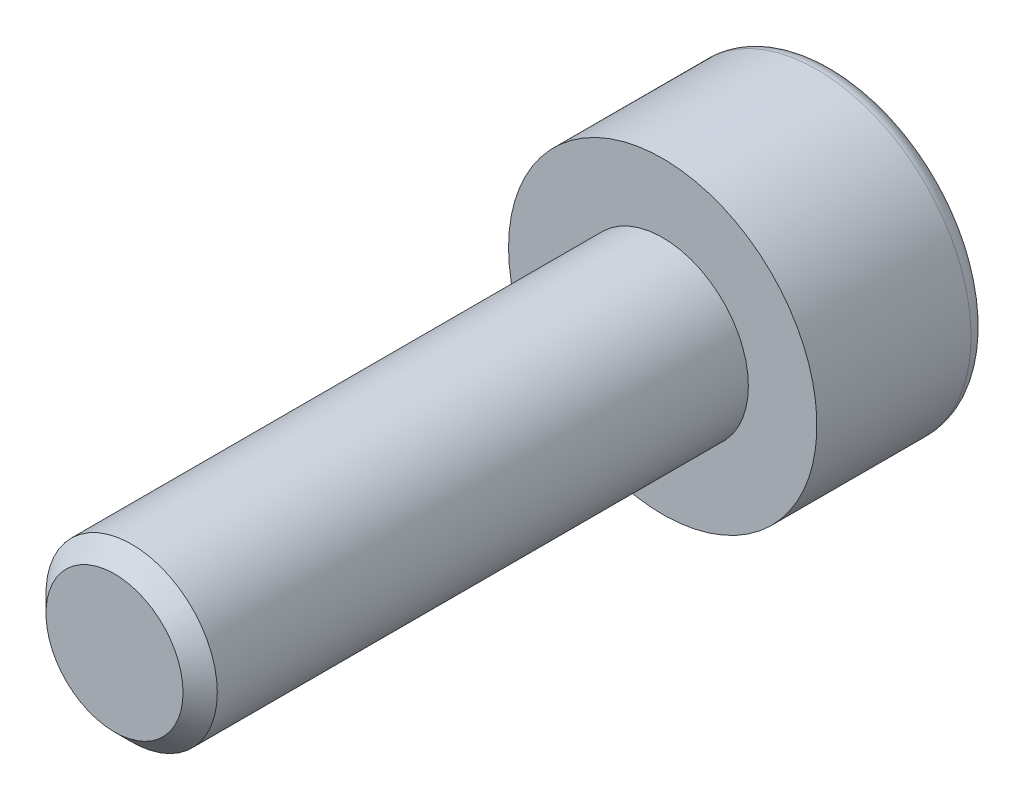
from build123d import *

# Parameters (mm, degrees)
ENLEV_MAT_EXTRU1_DEPTH = 1.1
ESQUISSE3_W            = 1.25
ESQUISSE3_H            = 8
CHANFREIN1_SIZE        = 0.25


with BuildPart() as part:
    # Esquisse1 → Base-R_volution (revolve)
    with BuildSketch(Plane(origin=(0, 0, 0), x_dir=(1, 0, 0), z_dir=(0, 1, 0)), mode=Mode.PRIVATE) as base_r_volution_sk:
        with BuildLine():
            Line((0, 0), (2.25, 0))
            Line((2.25, 0), (2.25, 2.25))
            ThreePointArc((2.25, 2.25), (2.176776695, 2.426776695), (2, 2.5))
            Line((2, 2.5), (0, 2.5))
            Line((0, 2.5), (0, 0))
        make_face()
    revolve(base_r_volution_sk.sketch.rotate(Axis((0, 0, 0), (0, 0, -1)), 180), axis=Axis((0, 0, 0), (0, 0, -1)))

    # Esquisse2 → enlev-mat-Extru1 (cut)
    with BuildSketch(Plane.XY.offset(-2.5)):
        Polygon((-1.154700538, 0), (-0.577350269, -1), (0.577350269, -1), (1.154700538, 0), (0.577350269, 1), (-0.577350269, 1), align=None)
    extrude(amount=ENLEV_MAT_EXTRU1_DEPTH, mode=Mode.SUBTRACT)

    # Esquisse3 → Boss.-R_vol.1 (revolve)
    with BuildSketch(Plane(origin=(0, 0, 0), x_dir=(1, 0, 0), z_dir=(0, 1, 0))):
        with Locations((0.625, -4)):
            Rectangle(ESQUISSE3_W, ESQUISSE3_H)
    revolve(axis=Axis((0, 0, 0), (0, 0, 1)))

    # Chanfrein1
    chanfrein1_edges = [part.edges().sort_by_distance(p)[0] for p in [
        (-1.25, 0, 8),
    ]]
    chamfer(chanfrein1_edges, length=CHANFREIN1_SIZE)


solid = part.part
